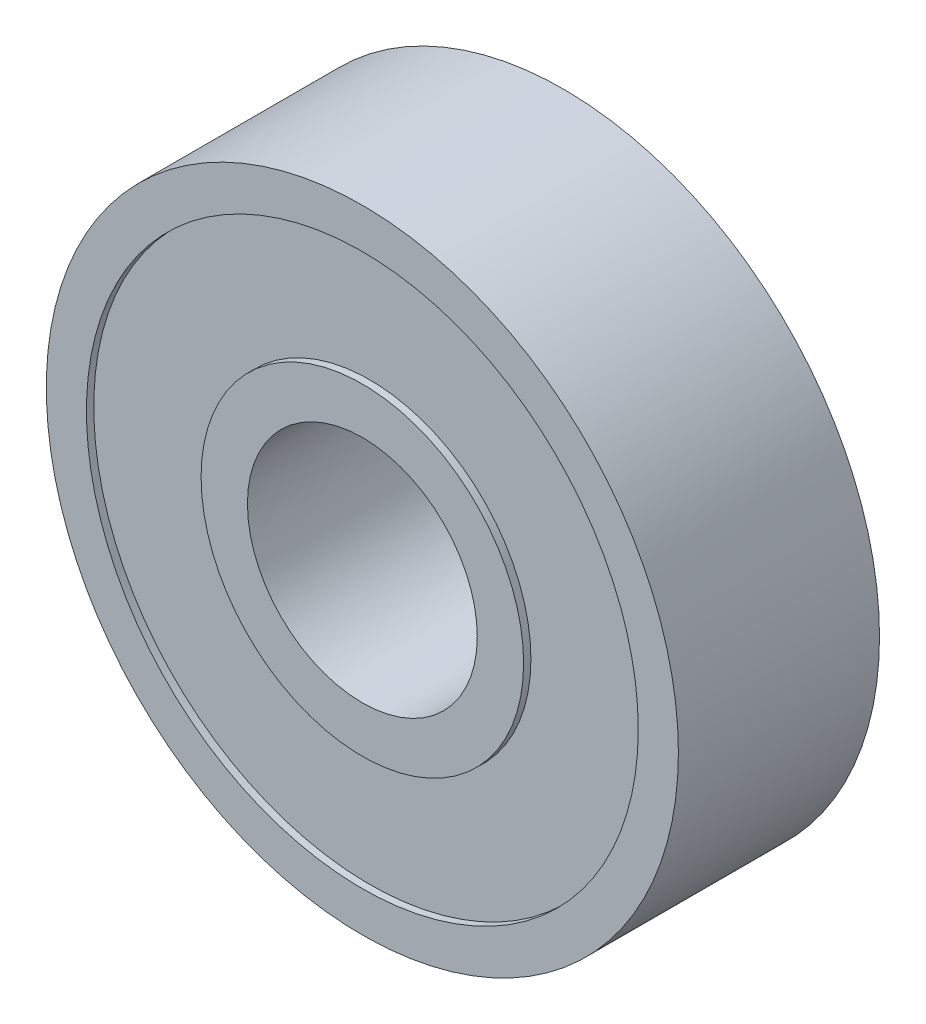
from build123d import *

# Parameters (mm, degrees)
SKETCH1_R             = 11
SKETCH1_R_2           = 9.603
BOSS_EXTRUDE1_DEPTH   = 7
SKETCH1_R_3           = 5.6129
SKETCH1_R_4           = 4
BOSS_EXTRUDE1_2_DEPTH = 7
BOSS_EXTRUDE2_START   = -6.74599997
SKETCH3_R             = 9.603
SKETCH3_R_2           = 5.6129
BOSS_EXTRUDE2_DEPTH   = 6.49199997


with BuildPart() as part:
    # Sketch1 → Boss-Extrude1 (new body)
    with BuildSketch(Plane.XY):
        Circle(SKETCH1_R)
        Circle(SKETCH1_R_2, mode=Mode.SUBTRACT)
    extrude(amount=BOSS_EXTRUDE1_DEPTH)



with BuildPart() as body_2:
    # Sketch1 → Boss-Extrude1 2 (new body)
    with BuildSketch(Plane.XY):
        Circle(SKETCH1_R_3)
        Circle(SKETCH1_R_4, mode=Mode.SUBTRACT)
    extrude(amount=BOSS_EXTRUDE1_2_DEPTH)


with BuildPart() as part_1:
    add(part.part)

    add(body_2.part)  # Boss-Extrude2 merges body 2
    # Sketch3 → Boss-Extrude2 (add)
    with BuildSketch(Plane.XY.offset(7).offset(BOSS_EXTRUDE2_START)):
        Circle(SKETCH3_R)
        Circle(SKETCH3_R_2, mode=Mode.SUBTRACT)
    extrude(amount=BOSS_EXTRUDE2_DEPTH)


solid = part_1.part
